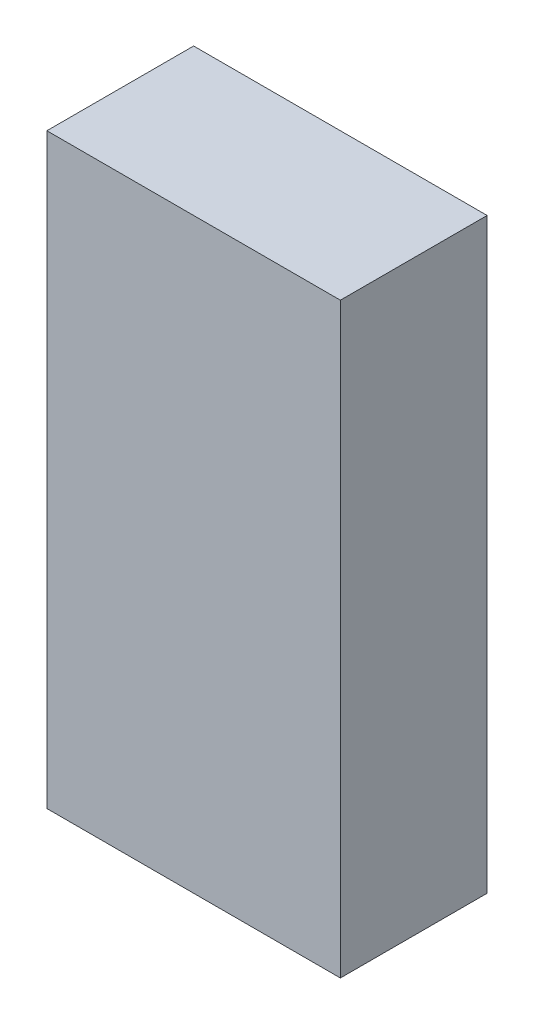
ISO-10303-21;
HEADER;
FILE_DESCRIPTION(('STEP AP214'),'2;1');
FILE_NAME('part.step','',(''),(''),'','','');
FILE_SCHEMA(('AUTOMOTIVE_DESIGN { 1 0 10303 214 1 1 1 1 }'));
ENDSEC;
DATA;
#1=APPLICATION_CONTEXT('core data for automotive mechanical design processes');
#2=APPLICATION_PROTOCOL_DEFINITION('international standard','automotive_design',2000,#1);
#3=PRODUCT_CONTEXT('',#1,'mechanical');
#4=PRODUCT('Part','Part','',(#3));
#5=PRODUCT_RELATED_PRODUCT_CATEGORY('part','',(#4));
#6=PRODUCT_DEFINITION_FORMATION('','',#4);
#7=PRODUCT_DEFINITION_CONTEXT('part definition',#1,'design');
#8=PRODUCT_DEFINITION('design','',#6,#7);
#9=PRODUCT_DEFINITION_SHAPE('','',#8);
#10=(LENGTH_UNIT() NAMED_UNIT(*) SI_UNIT(.MILLI.,.METRE.));
#11=(NAMED_UNIT(*) PLANE_ANGLE_UNIT() SI_UNIT($,.RADIAN.));
#12=(NAMED_UNIT(*) SI_UNIT($,.STERADIAN.) SOLID_ANGLE_UNIT());
#13=UNCERTAINTY_MEASURE_WITH_UNIT(LENGTH_MEASURE(1.E-05),#10,'distance_accuracy_value','');
#14=(GEOMETRIC_REPRESENTATION_CONTEXT(3) GLOBAL_UNCERTAINTY_ASSIGNED_CONTEXT((#13)) GLOBAL_UNIT_ASSIGNED_CONTEXT((#10,
#11,#12)) REPRESENTATION_CONTEXT('',''));
#15=CARTESIAN_POINT('',(0.,0.,0.));
#16=DIRECTION('',(0.,0.,1.));
#17=DIRECTION('',(1.,0.,0.));
#18=AXIS2_PLACEMENT_3D('',#15,#16,#17);
#19=CARTESIAN_POINT('',(457.2,1828.8,-228.6));
#20=DIRECTION('',(-1.,0.,0.));
#21=DIRECTION('',(0.,0.,1.));
#22=AXIS2_PLACEMENT_3D('',#19,#20,#21);
#23=PLANE('',#22);
#24=DIRECTION('',(0.,0.,-1.));
#25=VECTOR('',#24,1.);
#26=CARTESIAN_POINT('',(457.2,0.,-228.6));
#27=LINE('',#26,#25);
#28=CARTESIAN_POINT('',(457.2,0.,228.6));
#29=VERTEX_POINT('',#28);
#30=CARTESIAN_POINT('',(457.2,0.,-228.6));
#31=VERTEX_POINT('',#30);
#32=EDGE_CURVE('E101',#29,#31,#27,.T.);
#33=ORIENTED_EDGE('',*,*,#32,.T.);
#34=DIRECTION('',(0.,-1.,0.));
#35=VECTOR('',#34,1.);
#36=CARTESIAN_POINT('',(457.2,1828.8,-228.6));
#37=LINE('',#36,#35);
#38=CARTESIAN_POINT('',(457.2,1828.8,-228.6));
#39=VERTEX_POINT('',#38);
#40=EDGE_CURVE('E11',#39,#31,#37,.T.);
#41=ORIENTED_EDGE('',*,*,#40,.F.);
#42=DIRECTION('',(0.,0.,-1.));
#43=VECTOR('',#42,1.);
#44=CARTESIAN_POINT('',(457.2,1828.8,-228.6));
#45=LINE('',#44,#43);
#46=CARTESIAN_POINT('',(457.2,1828.8,228.6));
#47=VERTEX_POINT('',#46);
#48=EDGE_CURVE('E88',#47,#39,#45,.T.);
#49=ORIENTED_EDGE('',*,*,#48,.F.);
#50=DIRECTION('',(0.,-1.,0.));
#51=VECTOR('',#50,1.);
#52=CARTESIAN_POINT('',(457.2,1828.8,228.6));
#53=LINE('',#52,#51);
#54=EDGE_CURVE('E97',#47,#29,#53,.T.);
#55=ORIENTED_EDGE('',*,*,#54,.T.);
#56=EDGE_LOOP('',(#33,#41,#49,#55));
#57=FACE_BOUND('',#56,.T.);
#58=ADVANCED_FACE('F37',(#57),#23,.F.);
#59=CARTESIAN_POINT('',(-457.2,1828.8,-228.6));
#60=DIRECTION('',(0.,0.,1.));
#61=DIRECTION('',(1.,0.,0.));
#62=AXIS2_PLACEMENT_3D('',#59,#60,#61);
#63=PLANE('',#62);
#64=DIRECTION('',(-1.,0.,0.));
#65=VECTOR('',#64,1.);
#66=CARTESIAN_POINT('',(-457.2,0.,-228.6));
#67=LINE('',#66,#65);
#68=CARTESIAN_POINT('',(-457.2,0.,-228.6));
#69=VERTEX_POINT('',#68);
#70=EDGE_CURVE('E92',#31,#69,#67,.T.);
#71=ORIENTED_EDGE('',*,*,#70,.T.);
#72=DIRECTION('',(0.,-1.,0.));
#73=VECTOR('',#72,1.);
#74=CARTESIAN_POINT('',(-457.2,1828.8,-228.6));
#75=LINE('',#74,#73);
#76=CARTESIAN_POINT('',(-457.2,1828.8,-228.6));
#77=VERTEX_POINT('',#76);
#78=EDGE_CURVE('E45',#77,#69,#75,.T.);
#79=ORIENTED_EDGE('',*,*,#78,.F.);
#80=DIRECTION('',(-1.,0.,0.));
#81=VECTOR('',#80,1.);
#82=CARTESIAN_POINT('',(-457.2,1828.8,-228.6));
#83=LINE('',#82,#81);
#84=EDGE_CURVE('E83',#39,#77,#83,.T.);
#85=ORIENTED_EDGE('',*,*,#84,.F.);
#86=ORIENTED_EDGE('',*,*,#40,.T.);
#87=EDGE_LOOP('',(#71,#79,#85,#86));
#88=FACE_BOUND('',#87,.T.);
#89=ADVANCED_FACE('F91',(#88),#63,.F.);
#90=CARTESIAN_POINT('',(-457.2,1828.8,-228.6));
#91=DIRECTION('',(1.,0.,0.));
#92=DIRECTION('',(0.,0.,-1.));
#93=AXIS2_PLACEMENT_3D('',#90,#91,#92);
#94=PLANE('',#93);
#95=DIRECTION('',(0.,0.,1.));
#96=VECTOR('',#95,1.);
#97=CARTESIAN_POINT('',(-457.2,0.,-228.6));
#98=LINE('',#97,#96);
#99=CARTESIAN_POINT('',(-457.2,0.,228.6));
#100=VERTEX_POINT('',#99);
#101=EDGE_CURVE('E70',#69,#100,#98,.T.);
#102=ORIENTED_EDGE('',*,*,#101,.T.);
#103=DIRECTION('',(0.,-1.,0.));
#104=VECTOR('',#103,1.);
#105=CARTESIAN_POINT('',(-457.2,1828.8,228.6));
#106=LINE('',#105,#104);
#107=CARTESIAN_POINT('',(-457.2,1828.8,228.6));
#108=VERTEX_POINT('',#107);
#109=EDGE_CURVE('E94',#108,#100,#106,.T.);
#110=ORIENTED_EDGE('',*,*,#109,.F.);
#111=DIRECTION('',(0.,0.,1.));
#112=VECTOR('',#111,1.);
#113=CARTESIAN_POINT('',(-457.2,1828.8,-228.6));
#114=LINE('',#113,#112);
#115=EDGE_CURVE('E86',#77,#108,#114,.T.);
#116=ORIENTED_EDGE('',*,*,#115,.F.);
#117=ORIENTED_EDGE('',*,*,#78,.T.);
#118=EDGE_LOOP('',(#102,#110,#116,#117));
#119=FACE_BOUND('',#118,.T.);
#120=ADVANCED_FACE('F95',(#119),#94,.F.);
#121=CARTESIAN_POINT('',(-457.2,1828.8,228.6));
#122=DIRECTION('',(0.,0.,-1.));
#123=DIRECTION('',(-1.,0.,0.));
#124=AXIS2_PLACEMENT_3D('',#121,#122,#123);
#125=PLANE('',#124);
#126=DIRECTION('',(1.,0.,0.));
#127=VECTOR('',#126,1.);
#128=CARTESIAN_POINT('',(-457.2,0.,228.6));
#129=LINE('',#128,#127);
#130=EDGE_CURVE('E76',#100,#29,#129,.T.);
#131=ORIENTED_EDGE('',*,*,#130,.T.);
#132=ORIENTED_EDGE('',*,*,#54,.F.);
#133=DIRECTION('',(1.,0.,0.));
#134=VECTOR('',#133,1.);
#135=CARTESIAN_POINT('',(-457.2,1828.8,228.6));
#136=LINE('',#135,#134);
#137=EDGE_CURVE('E53',#108,#47,#136,.T.);
#138=ORIENTED_EDGE('',*,*,#137,.F.);
#139=ORIENTED_EDGE('',*,*,#109,.T.);
#140=EDGE_LOOP('',(#131,#132,#138,#139));
#141=FACE_BOUND('',#140,.T.);
#142=ADVANCED_FACE('F110',(#141),#125,.F.);
#143=CARTESIAN_POINT('',(0.,1828.8,0.));
#144=DIRECTION('',(0.,1.,0.));
#145=DIRECTION('',(0.,0.,1.));
#146=AXIS2_PLACEMENT_3D('',#143,#144,#145);
#147=PLANE('',#146);
#148=ORIENTED_EDGE('',*,*,#48,.T.);
#149=ORIENTED_EDGE('',*,*,#84,.T.);
#150=ORIENTED_EDGE('',*,*,#115,.T.);
#151=ORIENTED_EDGE('',*,*,#137,.T.);
#152=EDGE_LOOP('',(#148,#149,#150,#151));
#153=FACE_BOUND('',#152,.T.);
#154=ADVANCED_FACE('F84',(#153),#147,.T.);
#155=CARTESIAN_POINT('',(0.,0.,0.));
#156=DIRECTION('',(0.,1.,0.));
#157=DIRECTION('',(0.,0.,1.));
#158=AXIS2_PLACEMENT_3D('',#155,#156,#157);
#159=PLANE('',#158);
#160=ORIENTED_EDGE('',*,*,#32,.F.);
#161=ORIENTED_EDGE('',*,*,#130,.F.);
#162=ORIENTED_EDGE('',*,*,#101,.F.);
#163=ORIENTED_EDGE('',*,*,#70,.F.);
#164=EDGE_LOOP('',(#160,#161,#162,#163));
#165=FACE_BOUND('',#164,.T.);
#166=ADVANCED_FACE('F113',(#165),#159,.F.);
#167=CLOSED_SHELL('',(#58,#89,#120,#142,#154,#166));
#168=MANIFOLD_SOLID_BREP('B2',#167);
#169=ADVANCED_BREP_SHAPE_REPRESENTATION('',(#18,#168),#14);
#170=SHAPE_DEFINITION_REPRESENTATION(#9,#169);
ENDSEC;
END-ISO-10303-21;
